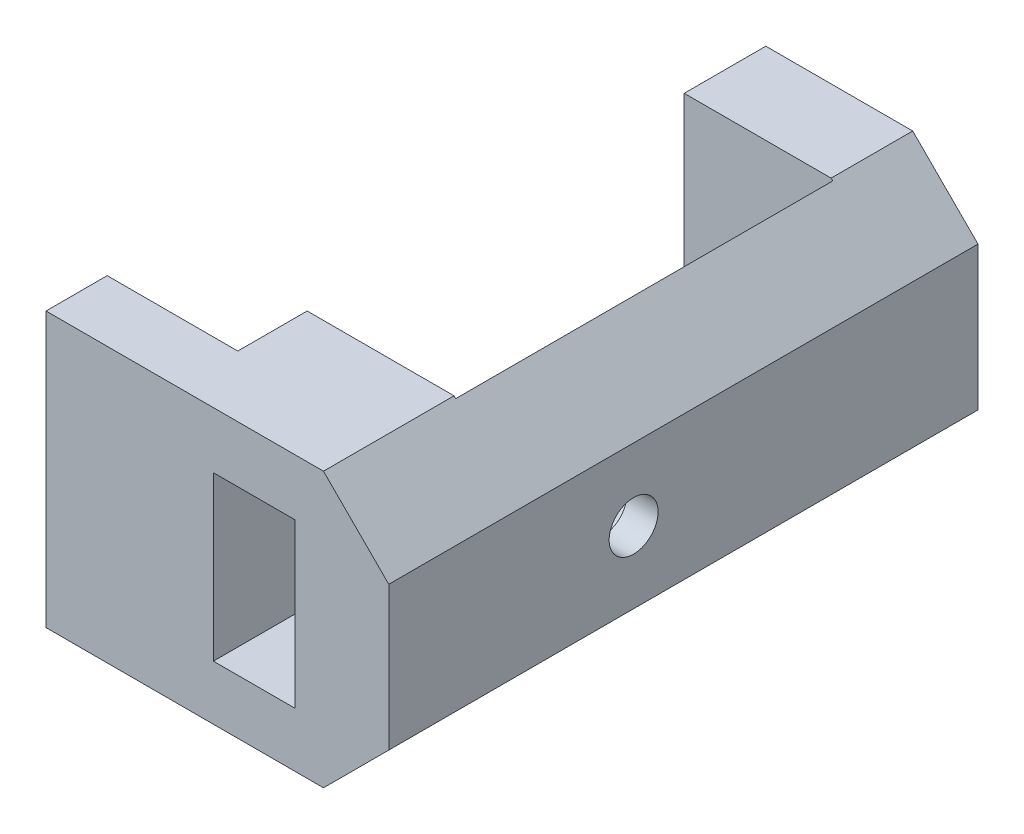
ISO-10303-21;
HEADER;
FILE_DESCRIPTION(('STEP AP214'),'2;1');
FILE_NAME('part.step','',(''),(''),'','','');
FILE_SCHEMA(('AUTOMOTIVE_DESIGN { 1 0 10303 214 1 1 1 1 }'));
ENDSEC;
DATA;
#1=APPLICATION_CONTEXT('core data for automotive mechanical design processes');
#2=APPLICATION_PROTOCOL_DEFINITION('international standard','automotive_design',2000,#1);
#3=PRODUCT_CONTEXT('',#1,'mechanical');
#4=PRODUCT('Part','Part','',(#3));
#5=PRODUCT_RELATED_PRODUCT_CATEGORY('part','',(#4));
#6=PRODUCT_DEFINITION_FORMATION('','',#4);
#7=PRODUCT_DEFINITION_CONTEXT('part definition',#1,'design');
#8=PRODUCT_DEFINITION('design','',#6,#7);
#9=PRODUCT_DEFINITION_SHAPE('','',#8);
#10=(LENGTH_UNIT() NAMED_UNIT(*) SI_UNIT(.MILLI.,.METRE.));
#11=(NAMED_UNIT(*) PLANE_ANGLE_UNIT() SI_UNIT($,.RADIAN.));
#12=(NAMED_UNIT(*) SI_UNIT($,.STERADIAN.) SOLID_ANGLE_UNIT());
#13=UNCERTAINTY_MEASURE_WITH_UNIT(LENGTH_MEASURE(1.E-05),#10,'distance_accuracy_value','');
#14=(GEOMETRIC_REPRESENTATION_CONTEXT(3) GLOBAL_UNCERTAINTY_ASSIGNED_CONTEXT((#13)) GLOBAL_UNIT_ASSIGNED_CONTEXT((#10,
#11,#12)) REPRESENTATION_CONTEXT('',''));
#15=CARTESIAN_POINT('',(0.,0.,0.));
#16=DIRECTION('',(0.,0.,1.));
#17=DIRECTION('',(1.,0.,0.));
#18=AXIS2_PLACEMENT_3D('',#15,#16,#17);
#19=CARTESIAN_POINT('',(0.,0.,0.));
#20=DIRECTION('',(0.,-1.,0.));
#21=DIRECTION('',(0.,0.,-1.));
#22=AXIS2_PLACEMENT_3D('',#19,#20,#21);
#23=PLANE('',#22);
#24=DIRECTION('',(-1.,0.,0.));
#25=VECTOR('',#24,1.);
#26=CARTESIAN_POINT('',(0.,0.,-33.1));
#27=LINE('',#26,#25);
#28=CARTESIAN_POINT('',(8.99999999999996,0.,-33.1));
#29=VERTEX_POINT('',#28);
#30=CARTESIAN_POINT('',(0.,0.,-33.1));
#31=VERTEX_POINT('',#30);
#32=EDGE_CURVE('E323',#29,#31,#27,.T.);
#33=ORIENTED_EDGE('',*,*,#32,.F.);
#34=DIRECTION('',(0.,0.,1.));
#35=VECTOR('',#34,1.);
#36=CARTESIAN_POINT('',(8.99999999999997,0.,0.));
#37=LINE('',#36,#35);
#38=CARTESIAN_POINT('',(8.99999999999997,0.,-28.1));
#39=VERTEX_POINT('',#38);
#40=EDGE_CURVE('E11',#29,#39,#37,.T.);
#41=ORIENTED_EDGE('',*,*,#40,.T.);
#42=DIRECTION('',(1.,0.,0.));
#43=VECTOR('',#42,1.);
#44=CARTESIAN_POINT('',(0.,0.,-28.1));
#45=LINE('',#44,#43);
#46=CARTESIAN_POINT('',(0.,0.,-28.1));
#47=VERTEX_POINT('',#46);
#48=EDGE_CURVE('E327',#47,#39,#45,.T.);
#49=ORIENTED_EDGE('',*,*,#48,.F.);
#50=DIRECTION('',(0.,0.,1.));
#51=VECTOR('',#50,1.);
#52=CARTESIAN_POINT('',(0.,0.,-33.1));
#53=LINE('',#52,#51);
#54=EDGE_CURVE('E325',#31,#47,#53,.T.);
#55=ORIENTED_EDGE('',*,*,#54,.F.);
#56=EDGE_LOOP('',(#33,#41,#49,#55));
#57=FACE_BOUND('',#56,.T.);
#58=ADVANCED_FACE('F36',(#57),#23,.T.);
#59=CARTESIAN_POINT('',(0.,16.8,0.));
#60=DIRECTION('',(0.,-1.,0.));
#61=DIRECTION('',(0.,0.,-1.));
#62=AXIS2_PLACEMENT_3D('',#59,#60,#61);
#63=PLANE('',#62);
#64=DIRECTION('',(0.,0.,1.));
#65=VECTOR('',#64,1.);
#66=CARTESIAN_POINT('',(0.,16.8,0.));
#67=LINE('',#66,#65);
#68=CARTESIAN_POINT('',(0.,16.8,-5.));
#69=VERTEX_POINT('',#68);
#70=CARTESIAN_POINT('',(0.,16.8,-0.750000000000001));
#71=VERTEX_POINT('',#70);
#72=EDGE_CURVE('E307',#69,#71,#67,.T.);
#73=ORIENTED_EDGE('',*,*,#72,.T.);
#74=DIRECTION('',(1.,0.,0.));
#75=VECTOR('',#74,1.);
#76=CARTESIAN_POINT('',(-8.,16.8,-0.749999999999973));
#77=LINE('',#76,#75);
#78=CARTESIAN_POINT('',(-8.,16.8,-0.749999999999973));
#79=VERTEX_POINT('',#78);
#80=EDGE_CURVE('E242',#79,#71,#77,.T.);
#81=ORIENTED_EDGE('',*,*,#80,.F.);
#82=DIRECTION('',(0.,0.,-1.));
#83=VECTOR('',#82,1.);
#84=CARTESIAN_POINT('',(-8.,16.8,0.));
#85=LINE('',#84,#83);
#86=CARTESIAN_POINT('',(-7.99999999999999,16.8,3.00000000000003));
#87=VERTEX_POINT('',#86);
#88=EDGE_CURVE('E240',#87,#79,#85,.T.);
#89=ORIENTED_EDGE('',*,*,#88,.F.);
#90=DIRECTION('',(-1.,0.,0.));
#91=VECTOR('',#90,1.);
#92=CARTESIAN_POINT('',(8.99999999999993,16.8,3.));
#93=LINE('',#92,#91);
#94=CARTESIAN_POINT('',(8.99999999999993,16.8,3.));
#95=VERTEX_POINT('',#94);
#96=EDGE_CURVE('E260',#95,#87,#93,.T.);
#97=ORIENTED_EDGE('',*,*,#96,.F.);
#98=DIRECTION('',(0.,0.,-1.));
#99=VECTOR('',#98,1.);
#100=CARTESIAN_POINT('',(8.99999999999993,16.8,0.));
#101=LINE('',#100,#99);
#102=CARTESIAN_POINT('',(8.99999999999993,16.8,-5.));
#103=VERTEX_POINT('',#102);
#104=EDGE_CURVE('E352',#95,#103,#101,.T.);
#105=ORIENTED_EDGE('',*,*,#104,.T.);
#106=DIRECTION('',(-1.,0.,0.));
#107=VECTOR('',#106,1.);
#108=CARTESIAN_POINT('',(0.,16.8,-5.));
#109=LINE('',#108,#107);
#110=EDGE_CURVE('E318',#103,#69,#109,.T.);
#111=ORIENTED_EDGE('',*,*,#110,.T.);
#112=EDGE_LOOP('',(#73,#81,#89,#97,#105,#111));
#113=FACE_BOUND('',#112,.T.);
#114=ADVANCED_FACE('F408',(#113),#63,.F.);
#115=CARTESIAN_POINT('',(3.,8.40000000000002,-12.));
#116=DIRECTION('',(1.,0.,0.));
#117=DIRECTION('',(0.,0.,-1.));
#118=AXIS2_PLACEMENT_3D('',#115,#116,#117);
#119=CYLINDRICAL_SURFACE('',#118,1.5);
#120=CARTESIAN_POINT('',(13.,8.40000000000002,-12.));
#121=DIRECTION('',(1.,0.,0.));
#122=DIRECTION('',(0.,0.,-1.));
#123=AXIS2_PLACEMENT_3D('',#120,#121,#122);
#124=CIRCLE('',#123,1.5);
#125=CARTESIAN_POINT('',(13.,8.40000000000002,-13.5));
#126=VERTEX_POINT('',#125);
#127=EDGE_CURVE('E303',#126,#126,#124,.T.);
#128=ORIENTED_EDGE('',*,*,#127,.T.);
#129=EDGE_LOOP('',(#128));
#130=FACE_BOUND('',#129,.T.);
#131=CARTESIAN_POINT('',(11.1,8.40000000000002,-12.));
#132=DIRECTION('',(-1.,0.,0.));
#133=DIRECTION('',(0.,0.,1.));
#134=AXIS2_PLACEMENT_3D('',#131,#132,#133);
#135=CIRCLE('',#134,1.5);
#136=CARTESIAN_POINT('',(11.1,8.40000000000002,-10.5));
#137=VERTEX_POINT('',#136);
#138=EDGE_CURVE('E294',#137,#137,#135,.F.);
#139=ORIENTED_EDGE('',*,*,#138,.F.);
#140=EDGE_LOOP('',(#139));
#141=FACE_BOUND('',#140,.T.);
#142=ADVANCED_FACE('F450',(#130,#141),#119,.F.);
#143=CARTESIAN_POINT('',(0.,16.8,0.));
#144=DIRECTION('',(1.,0.,0.));
#145=DIRECTION('',(0.,0.,-1.));
#146=AXIS2_PLACEMENT_3D('',#143,#144,#145);
#147=PLANE('',#146);
#148=DIRECTION('',(0.,0.,1.));
#149=VECTOR('',#148,1.);
#150=CARTESIAN_POINT('',(0.,0.,0.));
#151=LINE('',#150,#149);
#152=CARTESIAN_POINT('',(0.,0.,-5.));
#153=VERTEX_POINT('',#152);
#154=CARTESIAN_POINT('',(0.,0.,-0.750000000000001));
#155=VERTEX_POINT('',#154);
#156=EDGE_CURVE('E306',#153,#155,#151,.T.);
#157=ORIENTED_EDGE('',*,*,#156,.T.);
#158=DIRECTION('',(0.,1.,0.));
#159=VECTOR('',#158,1.);
#160=CARTESIAN_POINT('',(0.,0.,-0.750000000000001));
#161=LINE('',#160,#159);
#162=EDGE_CURVE('E227',#155,#71,#161,.T.);
#163=ORIENTED_EDGE('',*,*,#162,.T.);
#164=ORIENTED_EDGE('',*,*,#72,.F.);
#165=DIRECTION('',(0.,-1.,0.));
#166=VECTOR('',#165,1.);
#167=CARTESIAN_POINT('',(0.,16.8,-5.));
#168=LINE('',#167,#166);
#169=EDGE_CURVE('E320',#69,#153,#168,.T.);
#170=ORIENTED_EDGE('',*,*,#169,.T.);
#171=EDGE_LOOP('',(#157,#163,#164,#170));
#172=FACE_BOUND('',#171,.T.);
#173=ADVANCED_FACE('F419',(#172),#147,.F.);
#174=CARTESIAN_POINT('',(13.,16.8,0.));
#175=DIRECTION('',(-1.,0.,0.));
#176=DIRECTION('',(0.,0.,1.));
#177=AXIS2_PLACEMENT_3D('',#174,#175,#176);
#178=PLANE('',#177);
#179=ORIENTED_EDGE('',*,*,#127,.F.);
#180=EDGE_LOOP('',(#179));
#181=FACE_BOUND('',#180,.T.);
#182=DIRECTION('',(0.,-1.,0.));
#183=VECTOR('',#182,1.);
#184=CARTESIAN_POINT('',(13.,16.8,-33.1));
#185=LINE('',#184,#183);
#186=CARTESIAN_POINT('',(13.,12.8,-33.1));
#187=VERTEX_POINT('',#186);
#188=CARTESIAN_POINT('',(13.,4.00000000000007,-33.1));
#189=VERTEX_POINT('',#188);
#190=EDGE_CURVE('E345',#187,#189,#185,.T.);
#191=ORIENTED_EDGE('',*,*,#190,.F.);
#192=DIRECTION('',(0.,0.,1.));
#193=VECTOR('',#192,1.);
#194=CARTESIAN_POINT('',(13.,12.8,0.));
#195=LINE('',#194,#193);
#196=CARTESIAN_POINT('',(13.,12.8,3.));
#197=VERTEX_POINT('',#196);
#198=EDGE_CURVE('E374',#187,#197,#195,.T.);
#199=ORIENTED_EDGE('',*,*,#198,.T.);
#200=DIRECTION('',(0.,1.,0.));
#201=VECTOR('',#200,1.);
#202=CARTESIAN_POINT('',(13.,4.00000000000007,3.));
#203=LINE('',#202,#201);
#204=CARTESIAN_POINT('',(13.,4.00000000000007,3.));
#205=VERTEX_POINT('',#204);
#206=EDGE_CURVE('E254',#205,#197,#203,.T.);
#207=ORIENTED_EDGE('',*,*,#206,.F.);
#208=DIRECTION('',(0.,0.,-1.));
#209=VECTOR('',#208,1.);
#210=CARTESIAN_POINT('',(13.,4.00000000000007,-33.1));
#211=LINE('',#210,#209);
#212=EDGE_CURVE('E371',#205,#189,#211,.T.);
#213=ORIENTED_EDGE('',*,*,#212,.T.);
#214=EDGE_LOOP('',(#191,#199,#207,#213));
#215=FACE_BOUND('',#214,.T.);
#216=ADVANCED_FACE('F392',(#181,#215),#178,.F.);
#217=CARTESIAN_POINT('',(0.,16.8,-33.1));
#218=DIRECTION('',(0.,0.,1.));
#219=DIRECTION('',(1.,0.,0.));
#220=AXIS2_PLACEMENT_3D('',#217,#218,#219);
#221=PLANE('',#220);
#222=DIRECTION('',(-1.,0.,0.));
#223=VECTOR('',#222,1.);
#224=CARTESIAN_POINT('',(0.,16.8,-33.1));
#225=LINE('',#224,#223);
#226=CARTESIAN_POINT('',(8.99999999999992,16.8,-33.1));
#227=VERTEX_POINT('',#226);
#228=CARTESIAN_POINT('',(0.,16.8,-33.1));
#229=VERTEX_POINT('',#228);
#230=EDGE_CURVE('E310',#227,#229,#225,.T.);
#231=ORIENTED_EDGE('',*,*,#230,.F.);
#232=DIRECTION('',(-0.707106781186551,0.707106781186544,0.));
#233=VECTOR('',#232,1.);
#234=CARTESIAN_POINT('',(8.99999999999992,16.8,-33.1));
#235=LINE('',#234,#233);
#236=EDGE_CURVE('E369',#227,#187,#235,.F.);
#237=ORIENTED_EDGE('',*,*,#236,.T.);
#238=ORIENTED_EDGE('',*,*,#190,.T.);
#239=DIRECTION('',(-0.707106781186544,-0.707106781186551,0.));
#240=VECTOR('',#239,1.);
#241=CARTESIAN_POINT('',(13.,4.00000000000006,-33.1));
#242=LINE('',#241,#240);
#243=EDGE_CURVE('E367',#189,#29,#242,.T.);
#244=ORIENTED_EDGE('',*,*,#243,.T.);
#245=ORIENTED_EDGE('',*,*,#32,.T.);
#246=DIRECTION('',(0.,-1.,0.));
#247=VECTOR('',#246,1.);
#248=CARTESIAN_POINT('',(0.,16.8,-33.1));
#249=LINE('',#248,#247);
#250=EDGE_CURVE('E342',#229,#31,#249,.T.);
#251=ORIENTED_EDGE('',*,*,#250,.F.);
#252=EDGE_LOOP('',(#231,#237,#238,#244,#245,#251));
#253=FACE_BOUND('',#252,.T.);
#254=ADVANCED_FACE('F396',(#253),#221,.F.);
#255=CARTESIAN_POINT('',(0.,16.8,-33.1));
#256=DIRECTION('',(1.,0.,0.));
#257=DIRECTION('',(0.,0.,-1.));
#258=AXIS2_PLACEMENT_3D('',#255,#256,#257);
#259=PLANE('',#258);
#260=CARTESIAN_POINT('',(0.,8.4,-30.6));
#261=DIRECTION('',(-1.,0.,0.));
#262=DIRECTION('',(0.,0.,1.));
#263=AXIS2_PLACEMENT_3D('',#260,#261,#262);
#264=CIRCLE('',#263,1.);
#265=CARTESIAN_POINT('',(0.,8.4,-29.6));
#266=VERTEX_POINT('',#265);
#267=EDGE_CURVE('E214',#266,#266,#264,.T.);
#268=ORIENTED_EDGE('',*,*,#267,.F.);
#269=EDGE_LOOP('',(#268));
#270=FACE_BOUND('',#269,.T.);
#271=ORIENTED_EDGE('',*,*,#54,.T.);
#272=DIRECTION('',(0.,-1.,0.));
#273=VECTOR('',#272,1.);
#274=CARTESIAN_POINT('',(0.,16.8,-28.1));
#275=LINE('',#274,#273);
#276=CARTESIAN_POINT('',(0.,16.8,-28.1));
#277=VERTEX_POINT('',#276);
#278=EDGE_CURVE('E339',#277,#47,#275,.T.);
#279=ORIENTED_EDGE('',*,*,#278,.F.);
#280=DIRECTION('',(0.,0.,1.));
#281=VECTOR('',#280,1.);
#282=CARTESIAN_POINT('',(0.,16.8,-33.1));
#283=LINE('',#282,#281);
#284=EDGE_CURVE('E313',#229,#277,#283,.T.);
#285=ORIENTED_EDGE('',*,*,#284,.F.);
#286=ORIENTED_EDGE('',*,*,#250,.T.);
#287=EDGE_LOOP('',(#271,#279,#285,#286));
#288=FACE_BOUND('',#287,.T.);
#289=ADVANCED_FACE('F436',(#270,#288),#259,.F.);
#290=CARTESIAN_POINT('',(0.,16.8,-28.1));
#291=DIRECTION('',(0.,0.,-1.));
#292=DIRECTION('',(-1.,0.,0.));
#293=AXIS2_PLACEMENT_3D('',#290,#291,#292);
#294=PLANE('',#293);
#295=DIRECTION('',(0.,-1.,0.));
#296=VECTOR('',#295,1.);
#297=CARTESIAN_POINT('',(9.09999999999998,16.8,-28.1));
#298=LINE('',#297,#296);
#299=CARTESIAN_POINT('',(9.09999999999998,16.6999999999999,-28.1));
#300=VERTEX_POINT('',#299);
#301=CARTESIAN_POINT('',(9.09999999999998,0.100000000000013,-28.1));
#302=VERTEX_POINT('',#301);
#303=EDGE_CURVE('E336',#300,#302,#298,.T.);
#304=ORIENTED_EDGE('',*,*,#303,.F.);
#305=DIRECTION('',(0.707106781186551,-0.707106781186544,0.));
#306=VECTOR('',#305,1.);
#307=CARTESIAN_POINT('',(8.99999999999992,16.8,-28.1));
#308=LINE('',#307,#306);
#309=CARTESIAN_POINT('',(8.99999999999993,16.8,-28.1));
#310=VERTEX_POINT('',#309);
#311=EDGE_CURVE('E365',#300,#310,#308,.F.);
#312=ORIENTED_EDGE('',*,*,#311,.T.);
#313=DIRECTION('',(1.,0.,0.));
#314=VECTOR('',#313,1.);
#315=CARTESIAN_POINT('',(0.,16.8,-28.1));
#316=LINE('',#315,#314);
#317=EDGE_CURVE('E315',#277,#310,#316,.T.);
#318=ORIENTED_EDGE('',*,*,#317,.F.);
#319=ORIENTED_EDGE('',*,*,#278,.T.);
#320=ORIENTED_EDGE('',*,*,#48,.T.);
#321=DIRECTION('',(0.707106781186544,0.707106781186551,0.));
#322=VECTOR('',#321,1.);
#323=CARTESIAN_POINT('',(13.,4.00000000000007,-28.1));
#324=LINE('',#323,#322);
#325=EDGE_CURVE('E363',#39,#302,#324,.T.);
#326=ORIENTED_EDGE('',*,*,#325,.T.);
#327=EDGE_LOOP('',(#304,#312,#318,#319,#320,#326));
#328=FACE_BOUND('',#327,.T.);
#329=ADVANCED_FACE('F428',(#328),#294,.F.);
#330=CARTESIAN_POINT('',(9.09999999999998,16.8,-5.));
#331=DIRECTION('',(1.,0.,0.));
#332=DIRECTION('',(0.,0.,-1.));
#333=AXIS2_PLACEMENT_3D('',#330,#331,#332);
#334=PLANE('',#333);
#335=DIRECTION('',(0.,-0.914175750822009,-0.405318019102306));
#336=VECTOR('',#335,1.);
#337=CARTESIAN_POINT('',(9.09999999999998,11.8277742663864,-13.9861275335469));
#338=LINE('',#337,#336);
#339=CARTESIAN_POINT('',(9.09999999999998,11.8277742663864,-13.9861275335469));
#340=VERTEX_POINT('',#339);
#341=CARTESIAN_POINT('',(9.09999999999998,7.57032096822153,-15.8737542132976));
#342=VERTEX_POINT('',#341);
#343=EDGE_CURVE('E281',#340,#342,#338,.T.);
#344=ORIENTED_EDGE('',*,*,#343,.F.);
#345=DIRECTION('',(0.,0.102984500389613,-0.994682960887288));
#346=VECTOR('',#345,1.);
#347=CARTESIAN_POINT('',(9.09999999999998,11.3481600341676,-9.35374010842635));
#348=LINE('',#347,#346);
#349=CARTESIAN_POINT('',(9.09999999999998,11.3481600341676,-9.35374010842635));
#350=VERTEX_POINT('',#349);
#351=EDGE_CURVE('E262',#350,#340,#348,.T.);
#352=ORIENTED_EDGE('',*,*,#351,.F.);
#353=DIRECTION('',(0.,0.977823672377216,-0.20942985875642));
#354=VECTOR('',#353,1.);
#355=CARTESIAN_POINT('',(9.09999999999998,6.79428883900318,-8.37839391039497));
#356=LINE('',#355,#354);
#357=CARTESIAN_POINT('',(9.09999999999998,6.79428883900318,-8.37839391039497));
#358=VERTEX_POINT('',#357);
#359=EDGE_CURVE('E267',#358,#350,#356,.T.);
#360=ORIENTED_EDGE('',*,*,#359,.F.);
#361=DIRECTION('',(0.,0.501343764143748,0.86524818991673));
#362=VECTOR('',#361,1.);
#363=CARTESIAN_POINT('',(9.09999999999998,4.45945589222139,-12.4079842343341));
#364=LINE('',#363,#362);
#365=CARTESIAN_POINT('',(9.09999999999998,4.45945589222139,-12.4079842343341));
#366=VERTEX_POINT('',#365);
#367=EDGE_CURVE('E287',#366,#358,#364,.T.);
#368=ORIENTED_EDGE('',*,*,#367,.F.);
#369=DIRECTION('',(0.,-0.66797618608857,0.744182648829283));
#370=VECTOR('',#369,1.);
#371=CARTESIAN_POINT('',(9.09999999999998,7.57032096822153,-15.8737542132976));
#372=LINE('',#371,#370);
#373=EDGE_CURVE('E284',#342,#366,#372,.T.);
#374=ORIENTED_EDGE('',*,*,#373,.F.);
#375=EDGE_LOOP('',(#344,#352,#360,#368,#374));
#376=FACE_BOUND('',#375,.T.);
#377=DIRECTION('',(0.,-1.,0.));
#378=VECTOR('',#377,1.);
#379=CARTESIAN_POINT('',(9.09999999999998,16.8,-5.));
#380=LINE('',#379,#378);
#381=CARTESIAN_POINT('',(9.09999999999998,16.6999999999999,-5.));
#382=VERTEX_POINT('',#381);
#383=CARTESIAN_POINT('',(9.09999999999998,0.100000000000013,-5.));
#384=VERTEX_POINT('',#383);
#385=EDGE_CURVE('E333',#382,#384,#380,.T.);
#386=ORIENTED_EDGE('',*,*,#385,.F.);
#387=DIRECTION('',(0.,0.,1.));
#388=VECTOR('',#387,1.);
#389=CARTESIAN_POINT('',(9.09999999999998,16.6999999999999,0.));
#390=LINE('',#389,#388);
#391=EDGE_CURVE('E361',#382,#300,#390,.F.);
#392=ORIENTED_EDGE('',*,*,#391,.T.);
#393=ORIENTED_EDGE('',*,*,#303,.T.);
#394=DIRECTION('',(0.,0.,1.));
#395=VECTOR('',#394,1.);
#396=CARTESIAN_POINT('',(9.09999999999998,0.100000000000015,0.));
#397=LINE('',#396,#395);
#398=EDGE_CURVE('E359',#302,#384,#397,.T.);
#399=ORIENTED_EDGE('',*,*,#398,.T.);
#400=EDGE_LOOP('',(#386,#392,#393,#399));
#401=FACE_BOUND('',#400,.T.);
#402=ADVANCED_FACE('F424',(#376,#401),#334,.F.);
#403=CARTESIAN_POINT('',(0.,16.8,-5.));
#404=DIRECTION('',(0.,0.,1.));
#405=DIRECTION('',(1.,0.,0.));
#406=AXIS2_PLACEMENT_3D('',#403,#404,#405);
#407=PLANE('',#406);
#408=DIRECTION('',(0.,1.,0.));
#409=VECTOR('',#408,1.);
#410=CARTESIAN_POINT('',(7.25610982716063,13.3481855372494,-5.));
#411=LINE('',#410,#409);
#412=CARTESIAN_POINT('',(7.25610982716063,3.34818553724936,-5.));
#413=VERTEX_POINT('',#412);
#414=CARTESIAN_POINT('',(7.25610982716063,13.3481855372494,-5.));
#415=VERTEX_POINT('',#414);
#416=EDGE_CURVE('E198',#413,#415,#411,.T.);
#417=ORIENTED_EDGE('',*,*,#416,.T.);
#418=DIRECTION('',(-1.,0.,0.));
#419=VECTOR('',#418,1.);
#420=CARTESIAN_POINT('',(7.25610982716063,13.3481855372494,-5.));
#421=LINE('',#420,#419);
#422=CARTESIAN_POINT('',(2.25610982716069,13.3481855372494,-5.));
#423=VERTEX_POINT('',#422);
#424=EDGE_CURVE('E192',#415,#423,#421,.T.);
#425=ORIENTED_EDGE('',*,*,#424,.T.);
#426=DIRECTION('',(0.,-1.,0.));
#427=VECTOR('',#426,1.);
#428=CARTESIAN_POINT('',(2.25610982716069,13.3481855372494,-5.));
#429=LINE('',#428,#427);
#430=CARTESIAN_POINT('',(2.25610982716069,3.34818553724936,-5.));
#431=VERTEX_POINT('',#430);
#432=EDGE_CURVE('E201',#423,#431,#429,.T.);
#433=ORIENTED_EDGE('',*,*,#432,.T.);
#434=DIRECTION('',(1.,0.,0.));
#435=VECTOR('',#434,1.);
#436=CARTESIAN_POINT('',(7.25610982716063,3.34818553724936,-5.));
#437=LINE('',#436,#435);
#438=EDGE_CURVE('E51',#431,#413,#437,.T.);
#439=ORIENTED_EDGE('',*,*,#438,.T.);
#440=EDGE_LOOP('',(#417,#425,#433,#439));
#441=FACE_BOUND('',#440,.T.);
#442=ORIENTED_EDGE('',*,*,#110,.F.);
#443=DIRECTION('',(-0.707106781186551,0.707106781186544,0.));
#444=VECTOR('',#443,1.);
#445=CARTESIAN_POINT('',(8.99999999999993,16.8,-5.));
#446=LINE('',#445,#444);
#447=EDGE_CURVE('E357',#103,#382,#446,.F.);
#448=ORIENTED_EDGE('',*,*,#447,.T.);
#449=ORIENTED_EDGE('',*,*,#385,.T.);
#450=DIRECTION('',(-0.707106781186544,-0.707106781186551,0.));
#451=VECTOR('',#450,1.);
#452=CARTESIAN_POINT('',(13.,4.00000000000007,-5.));
#453=LINE('',#452,#451);
#454=CARTESIAN_POINT('',(8.99999999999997,0.,-5.));
#455=VERTEX_POINT('',#454);
#456=EDGE_CURVE('E355',#384,#455,#453,.T.);
#457=ORIENTED_EDGE('',*,*,#456,.T.);
#458=DIRECTION('',(-1.,0.,0.));
#459=VECTOR('',#458,1.);
#460=CARTESIAN_POINT('',(0.,0.,-5.));
#461=LINE('',#460,#459);
#462=EDGE_CURVE('E311',#455,#153,#461,.T.);
#463=ORIENTED_EDGE('',*,*,#462,.T.);
#464=ORIENTED_EDGE('',*,*,#169,.F.);
#465=EDGE_LOOP('',(#442,#448,#449,#457,#463,#464));
#466=FACE_BOUND('',#465,.T.);
#467=ADVANCED_FACE('F205',(#441,#466),#407,.F.);
#468=ORIENTED_EDGE('',*,*,#317,.T.);
#469=DIRECTION('',(0.,0.,-1.));
#470=VECTOR('',#469,1.);
#471=CARTESIAN_POINT('',(8.99999999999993,16.8,0.));
#472=LINE('',#471,#470);
#473=EDGE_CURVE('E348',#310,#227,#472,.T.);
#474=ORIENTED_EDGE('',*,*,#473,.T.);
#475=ORIENTED_EDGE('',*,*,#230,.T.);
#476=ORIENTED_EDGE('',*,*,#284,.T.);
#477=EDGE_LOOP('',(#468,#474,#475,#476));
#478=FACE_BOUND('',#477,.T.);
#479=ADVANCED_FACE('F438',(#478),#63,.F.);
#480=ORIENTED_EDGE('',*,*,#462,.F.);
#481=DIRECTION('',(0.,0.,1.));
#482=VECTOR('',#481,1.);
#483=CARTESIAN_POINT('',(8.99999999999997,0.,0.));
#484=LINE('',#483,#482);
#485=CARTESIAN_POINT('',(8.99999999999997,0.,3.));
#486=VERTEX_POINT('',#485);
#487=EDGE_CURVE('E44',#455,#486,#484,.T.);
#488=ORIENTED_EDGE('',*,*,#487,.T.);
#489=DIRECTION('',(1.,0.,0.));
#490=VECTOR('',#489,1.);
#491=CARTESIAN_POINT('',(0.,0.,3.));
#492=LINE('',#491,#490);
#493=CARTESIAN_POINT('',(-7.99999999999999,0.,3.00000000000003));
#494=VERTEX_POINT('',#493);
#495=EDGE_CURVE('E248',#494,#486,#492,.T.);
#496=ORIENTED_EDGE('',*,*,#495,.F.);
#497=DIRECTION('',(0.,0.,1.));
#498=VECTOR('',#497,1.);
#499=CARTESIAN_POINT('',(-8.,0.,0.));
#500=LINE('',#499,#498);
#501=CARTESIAN_POINT('',(-8.,0.,-0.749999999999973));
#502=VERTEX_POINT('',#501);
#503=EDGE_CURVE('E234',#502,#494,#500,.T.);
#504=ORIENTED_EDGE('',*,*,#503,.F.);
#505=DIRECTION('',(1.,0.,0.));
#506=VECTOR('',#505,1.);
#507=CARTESIAN_POINT('',(-8.,0.,-0.749999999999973));
#508=LINE('',#507,#506);
#509=EDGE_CURVE('E246',#502,#155,#508,.T.);
#510=ORIENTED_EDGE('',*,*,#509,.T.);
#511=ORIENTED_EDGE('',*,*,#156,.F.);
#512=EDGE_LOOP('',(#480,#488,#496,#504,#510,#511));
#513=FACE_BOUND('',#512,.T.);
#514=ADVANCED_FACE('F378',(#513),#23,.T.);
#515=CARTESIAN_POINT('',(11.1,0.,0.));
#516=DIRECTION('',(-1.,0.,0.));
#517=DIRECTION('',(0.,0.,1.));
#518=AXIS2_PLACEMENT_3D('',#515,#516,#517);
#519=PLANE('',#518);
#520=DIRECTION('',(0.,0.102984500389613,-0.994682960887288));
#521=VECTOR('',#520,1.);
#522=CARTESIAN_POINT('',(11.1,11.3481600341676,-9.35374010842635));
#523=LINE('',#522,#521);
#524=CARTESIAN_POINT('',(11.1,11.3481600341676,-9.35374010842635));
#525=VERTEX_POINT('',#524);
#526=CARTESIAN_POINT('',(11.1,11.8277742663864,-13.9861275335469));
#527=VERTEX_POINT('',#526);
#528=EDGE_CURVE('E263',#525,#527,#523,.T.);
#529=ORIENTED_EDGE('',*,*,#528,.T.);
#530=DIRECTION('',(0.,-0.914175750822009,-0.405318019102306));
#531=VECTOR('',#530,1.);
#532=CARTESIAN_POINT('',(11.1,11.8277742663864,-13.9861275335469));
#533=LINE('',#532,#531);
#534=CARTESIAN_POINT('',(11.1,7.57032096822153,-15.8737542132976));
#535=VERTEX_POINT('',#534);
#536=EDGE_CURVE('E266',#527,#535,#533,.T.);
#537=ORIENTED_EDGE('',*,*,#536,.T.);
#538=DIRECTION('',(0.,-0.66797618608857,0.744182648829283));
#539=VECTOR('',#538,1.);
#540=CARTESIAN_POINT('',(11.1,7.57032096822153,-15.8737542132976));
#541=LINE('',#540,#539);
#542=CARTESIAN_POINT('',(11.1,4.45945589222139,-12.4079842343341));
#543=VERTEX_POINT('',#542);
#544=EDGE_CURVE('E270',#535,#543,#541,.T.);
#545=ORIENTED_EDGE('',*,*,#544,.T.);
#546=DIRECTION('',(0.,0.501343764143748,0.86524818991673));
#547=VECTOR('',#546,1.);
#548=CARTESIAN_POINT('',(11.1,4.45945589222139,-12.4079842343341));
#549=LINE('',#548,#547);
#550=CARTESIAN_POINT('',(11.1,6.79428883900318,-8.37839391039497));
#551=VERTEX_POINT('',#550);
#552=EDGE_CURVE('E273',#543,#551,#549,.T.);
#553=ORIENTED_EDGE('',*,*,#552,.T.);
#554=DIRECTION('',(0.,0.977823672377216,-0.20942985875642));
#555=VECTOR('',#554,1.);
#556=CARTESIAN_POINT('',(11.1,6.79428883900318,-8.37839391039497));
#557=LINE('',#556,#555);
#558=EDGE_CURVE('E276',#551,#525,#557,.T.);
#559=ORIENTED_EDGE('',*,*,#558,.T.);
#560=EDGE_LOOP('',(#529,#537,#545,#553,#559));
#561=FACE_BOUND('',#560,.T.);
#562=ORIENTED_EDGE('',*,*,#138,.T.);
#563=EDGE_LOOP('',(#562));
#564=FACE_BOUND('',#563,.T.);
#565=ADVANCED_FACE('F445',(#561,#564),#519,.T.);
#566=CARTESIAN_POINT('',(11.1,11.3481600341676,-9.35374010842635));
#567=DIRECTION('',(0.,0.994682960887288,0.102984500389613));
#568=DIRECTION('',(0.,-0.102984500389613,0.994682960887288));
#569=AXIS2_PLACEMENT_3D('',#566,#567,#568);
#570=PLANE('',#569);
#571=ORIENTED_EDGE('',*,*,#351,.T.);
#572=DIRECTION('',(-1.,0.,0.));
#573=VECTOR('',#572,1.);
#574=CARTESIAN_POINT('',(11.1,11.8277742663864,-13.9861275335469));
#575=LINE('',#574,#573);
#576=EDGE_CURVE('E279',#527,#340,#575,.T.);
#577=ORIENTED_EDGE('',*,*,#576,.F.);
#578=ORIENTED_EDGE('',*,*,#528,.F.);
#579=DIRECTION('',(-1.,0.,0.));
#580=VECTOR('',#579,1.);
#581=CARTESIAN_POINT('',(11.1,11.3481600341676,-9.35374010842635));
#582=LINE('',#581,#580);
#583=EDGE_CURVE('E292',#525,#350,#582,.T.);
#584=ORIENTED_EDGE('',*,*,#583,.T.);
#585=EDGE_LOOP('',(#571,#577,#578,#584));
#586=FACE_BOUND('',#585,.T.);
#587=ADVANCED_FACE('F486',(#586),#570,.F.);
#588=CARTESIAN_POINT('',(11.1,6.79428883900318,-8.37839391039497));
#589=DIRECTION('',(0.,0.20942985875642,0.977823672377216));
#590=DIRECTION('',(0.,-0.977823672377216,0.20942985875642));
#591=AXIS2_PLACEMENT_3D('',#588,#589,#590);
#592=PLANE('',#591);
#593=ORIENTED_EDGE('',*,*,#359,.T.);
#594=ORIENTED_EDGE('',*,*,#583,.F.);
#595=ORIENTED_EDGE('',*,*,#558,.F.);
#596=DIRECTION('',(-1.,0.,0.));
#597=VECTOR('',#596,1.);
#598=CARTESIAN_POINT('',(11.1,6.79428883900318,-8.37839391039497));
#599=LINE('',#598,#597);
#600=EDGE_CURVE('E295',#551,#358,#599,.T.);
#601=ORIENTED_EDGE('',*,*,#600,.T.);
#602=EDGE_LOOP('',(#593,#594,#595,#601));
#603=FACE_BOUND('',#602,.T.);
#604=ADVANCED_FACE('F488',(#603),#592,.F.);
#605=CARTESIAN_POINT('',(11.1,4.45945589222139,-12.4079842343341));
#606=DIRECTION('',(0.,-0.865248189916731,0.501343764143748));
#607=DIRECTION('',(0.,-0.501343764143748,-0.86524818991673));
#608=AXIS2_PLACEMENT_3D('',#605,#606,#607);
#609=PLANE('',#608);
#610=ORIENTED_EDGE('',*,*,#367,.T.);
#611=ORIENTED_EDGE('',*,*,#600,.F.);
#612=ORIENTED_EDGE('',*,*,#552,.F.);
#613=DIRECTION('',(-1.,0.,0.));
#614=VECTOR('',#613,1.);
#615=CARTESIAN_POINT('',(11.1,4.45945589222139,-12.4079842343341));
#616=LINE('',#615,#614);
#617=EDGE_CURVE('E297',#543,#366,#616,.T.);
#618=ORIENTED_EDGE('',*,*,#617,.T.);
#619=EDGE_LOOP('',(#610,#611,#612,#618));
#620=FACE_BOUND('',#619,.T.);
#621=ADVANCED_FACE('F481',(#620),#609,.F.);
#622=CARTESIAN_POINT('',(11.1,7.57032096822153,-15.8737542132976));
#623=DIRECTION('',(0.,-0.744182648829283,-0.66797618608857));
#624=DIRECTION('',(0.,0.66797618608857,-0.744182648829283));
#625=AXIS2_PLACEMENT_3D('',#622,#623,#624);
#626=PLANE('',#625);
#627=ORIENTED_EDGE('',*,*,#373,.T.);
#628=ORIENTED_EDGE('',*,*,#617,.F.);
#629=ORIENTED_EDGE('',*,*,#544,.F.);
#630=DIRECTION('',(-1.,0.,0.));
#631=VECTOR('',#630,1.);
#632=CARTESIAN_POINT('',(11.1,7.57032096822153,-15.8737542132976));
#633=LINE('',#632,#631);
#634=EDGE_CURVE('E299',#535,#342,#633,.T.);
#635=ORIENTED_EDGE('',*,*,#634,.T.);
#636=EDGE_LOOP('',(#627,#628,#629,#635));
#637=FACE_BOUND('',#636,.T.);
#638=ADVANCED_FACE('F475',(#637),#626,.F.);
#639=CARTESIAN_POINT('',(11.1,11.8277742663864,-13.9861275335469));
#640=DIRECTION('',(0.,0.405318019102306,-0.914175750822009));
#641=DIRECTION('',(0.,0.914175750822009,0.405318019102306));
#642=AXIS2_PLACEMENT_3D('',#639,#640,#641);
#643=PLANE('',#642);
#644=ORIENTED_EDGE('',*,*,#343,.T.);
#645=ORIENTED_EDGE('',*,*,#634,.F.);
#646=ORIENTED_EDGE('',*,*,#536,.F.);
#647=ORIENTED_EDGE('',*,*,#576,.T.);
#648=EDGE_LOOP('',(#644,#645,#646,#647));
#649=FACE_BOUND('',#648,.T.);
#650=ADVANCED_FACE('F470',(#649),#643,.F.);
#651=CARTESIAN_POINT('',(8.99999999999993,16.8,0.));
#652=DIRECTION('',(-0.707106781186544,-0.707106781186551,0.));
#653=DIRECTION('',(0.,0.,-1.));
#654=AXIS2_PLACEMENT_3D('',#651,#652,#653);
#655=PLANE('',#654);
#656=ORIENTED_EDGE('',*,*,#104,.F.);
#657=DIRECTION('',(-0.707106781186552,0.707106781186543,0.));
#658=VECTOR('',#657,1.);
#659=CARTESIAN_POINT('',(13.,12.8,3.));
#660=LINE('',#659,#658);
#661=EDGE_CURVE('E257',#197,#95,#660,.T.);
#662=ORIENTED_EDGE('',*,*,#661,.F.);
#663=ORIENTED_EDGE('',*,*,#198,.F.);
#664=ORIENTED_EDGE('',*,*,#236,.F.);
#665=ORIENTED_EDGE('',*,*,#473,.F.);
#666=ORIENTED_EDGE('',*,*,#311,.F.);
#667=ORIENTED_EDGE('',*,*,#391,.F.);
#668=ORIENTED_EDGE('',*,*,#447,.F.);
#669=EDGE_LOOP('',(#656,#662,#663,#664,#665,#666,#667,#668));
#670=FACE_BOUND('',#669,.T.);
#671=ADVANCED_FACE('F402',(#670),#655,.F.);
#672=CARTESIAN_POINT('',(13.,4.00000000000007,0.));
#673=DIRECTION('',(0.707106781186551,-0.707106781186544,0.));
#674=DIRECTION('',(0.,0.,1.));
#675=AXIS2_PLACEMENT_3D('',#672,#673,#674);
#676=PLANE('',#675);
#677=ORIENTED_EDGE('',*,*,#325,.F.);
#678=ORIENTED_EDGE('',*,*,#40,.F.);
#679=ORIENTED_EDGE('',*,*,#243,.F.);
#680=ORIENTED_EDGE('',*,*,#212,.F.);
#681=DIRECTION('',(0.707106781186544,0.707106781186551,0.));
#682=VECTOR('',#681,1.);
#683=CARTESIAN_POINT('',(8.99999999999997,0.,3.));
#684=LINE('',#683,#682);
#685=EDGE_CURVE('E251',#486,#205,#684,.T.);
#686=ORIENTED_EDGE('',*,*,#685,.F.);
#687=ORIENTED_EDGE('',*,*,#487,.F.);
#688=ORIENTED_EDGE('',*,*,#456,.F.);
#689=ORIENTED_EDGE('',*,*,#398,.F.);
#690=EDGE_LOOP('',(#677,#678,#679,#680,#686,#687,#688,#689));
#691=FACE_BOUND('',#690,.T.);
#692=ADVANCED_FACE('F38',(#691),#676,.T.);
#693=CARTESIAN_POINT('',(0.,0.,3.));
#694=DIRECTION('',(0.,0.,1.));
#695=DIRECTION('',(1.,0.,0.));
#696=AXIS2_PLACEMENT_3D('',#693,#694,#695);
#697=PLANE('',#696);
#698=DIRECTION('',(-1.,0.,0.));
#699=VECTOR('',#698,1.);
#700=CARTESIAN_POINT('',(7.25610982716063,13.3481855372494,3.));
#701=LINE('',#700,#699);
#702=CARTESIAN_POINT('',(7.25610982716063,13.3481855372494,3.));
#703=VERTEX_POINT('',#702);
#704=CARTESIAN_POINT('',(2.25610982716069,13.3481855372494,3.));
#705=VERTEX_POINT('',#704);
#706=EDGE_CURVE('E59',#703,#705,#701,.T.);
#707=ORIENTED_EDGE('',*,*,#706,.F.);
#708=DIRECTION('',(0.,1.,0.));
#709=VECTOR('',#708,1.);
#710=CARTESIAN_POINT('',(7.25610982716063,13.3481855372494,3.));
#711=LINE('',#710,#709);
#712=CARTESIAN_POINT('',(7.25610982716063,3.34818553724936,3.));
#713=VERTEX_POINT('',#712);
#714=EDGE_CURVE('E208',#713,#703,#711,.T.);
#715=ORIENTED_EDGE('',*,*,#714,.F.);
#716=DIRECTION('',(1.,0.,0.));
#717=VECTOR('',#716,1.);
#718=CARTESIAN_POINT('',(7.25610982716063,3.34818553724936,3.));
#719=LINE('',#718,#717);
#720=CARTESIAN_POINT('',(2.25610982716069,3.34818553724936,3.));
#721=VERTEX_POINT('',#720);
#722=EDGE_CURVE('E211',#721,#713,#719,.T.);
#723=ORIENTED_EDGE('',*,*,#722,.F.);
#724=DIRECTION('',(0.,-1.,0.));
#725=VECTOR('',#724,1.);
#726=CARTESIAN_POINT('',(2.25610982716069,13.3481855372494,3.));
#727=LINE('',#726,#725);
#728=EDGE_CURVE('E220',#705,#721,#727,.T.);
#729=ORIENTED_EDGE('',*,*,#728,.F.);
#730=EDGE_LOOP('',(#707,#715,#723,#729));
#731=FACE_BOUND('',#730,.T.);
#732=ORIENTED_EDGE('',*,*,#96,.T.);
#733=DIRECTION('',(0.,1.,0.));
#734=VECTOR('',#733,1.);
#735=CARTESIAN_POINT('',(-7.99999999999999,0.,3.00000000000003));
#736=LINE('',#735,#734);
#737=EDGE_CURVE('E237',#494,#87,#736,.T.);
#738=ORIENTED_EDGE('',*,*,#737,.F.);
#739=ORIENTED_EDGE('',*,*,#495,.T.);
#740=ORIENTED_EDGE('',*,*,#685,.T.);
#741=ORIENTED_EDGE('',*,*,#206,.T.);
#742=ORIENTED_EDGE('',*,*,#661,.T.);
#743=EDGE_LOOP('',(#732,#738,#739,#740,#741,#742));
#744=FACE_BOUND('',#743,.T.);
#745=ADVANCED_FACE('F386',(#731,#744),#697,.T.);
#746=CARTESIAN_POINT('',(-8.,0.,-0.749999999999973));
#747=DIRECTION('',(0.,0.,-1.));
#748=DIRECTION('',(-1.,0.,0.));
#749=AXIS2_PLACEMENT_3D('',#746,#747,#748);
#750=PLANE('',#749);
#751=ORIENTED_EDGE('',*,*,#162,.F.);
#752=ORIENTED_EDGE('',*,*,#509,.F.);
#753=DIRECTION('',(0.,1.,0.));
#754=VECTOR('',#753,1.);
#755=CARTESIAN_POINT('',(-8.,0.,-0.749999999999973));
#756=LINE('',#755,#754);
#757=EDGE_CURVE('E231',#502,#79,#756,.T.);
#758=ORIENTED_EDGE('',*,*,#757,.T.);
#759=ORIENTED_EDGE('',*,*,#80,.T.);
#760=EDGE_LOOP('',(#751,#752,#758,#759));
#761=FACE_BOUND('',#760,.T.);
#762=ADVANCED_FACE('F416',(#761),#750,.T.);
#763=CARTESIAN_POINT('',(-8.,0.,0.));
#764=DIRECTION('',(-1.,0.,0.));
#765=DIRECTION('',(0.,0.,1.));
#766=AXIS2_PLACEMENT_3D('',#763,#764,#765);
#767=PLANE('',#766);
#768=ORIENTED_EDGE('',*,*,#757,.F.);
#769=ORIENTED_EDGE('',*,*,#503,.T.);
#770=ORIENTED_EDGE('',*,*,#737,.T.);
#771=ORIENTED_EDGE('',*,*,#88,.T.);
#772=EDGE_LOOP('',(#768,#769,#770,#771));
#773=FACE_BOUND('',#772,.T.);
#774=ADVANCED_FACE('F413',(#773),#767,.T.);
#775=CARTESIAN_POINT('',(7.25610982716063,13.3481855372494,-5.));
#776=DIRECTION('',(0.,1.,0.));
#777=DIRECTION('',(0.,0.,1.));
#778=AXIS2_PLACEMENT_3D('',#775,#776,#777);
#779=PLANE('',#778);
#780=ORIENTED_EDGE('',*,*,#706,.T.);
#781=DIRECTION('',(0.,0.,1.));
#782=VECTOR('',#781,1.);
#783=CARTESIAN_POINT('',(2.25610982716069,13.3481855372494,-5.));
#784=LINE('',#783,#782);
#785=EDGE_CURVE('E188',#423,#705,#784,.T.);
#786=ORIENTED_EDGE('',*,*,#785,.F.);
#787=ORIENTED_EDGE('',*,*,#424,.F.);
#788=DIRECTION('',(0.,0.,1.));
#789=VECTOR('',#788,1.);
#790=CARTESIAN_POINT('',(7.25610982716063,13.3481855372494,-5.));
#791=LINE('',#790,#789);
#792=EDGE_CURVE('E225',#415,#703,#791,.T.);
#793=ORIENTED_EDGE('',*,*,#792,.T.);
#794=EDGE_LOOP('',(#780,#786,#787,#793));
#795=FACE_BOUND('',#794,.T.);
#796=ADVANCED_FACE('F190',(#795),#779,.F.);
#797=CARTESIAN_POINT('',(7.25610982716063,13.3481855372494,-5.));
#798=DIRECTION('',(1.,0.,0.));
#799=DIRECTION('',(0.,0.,-1.));
#800=AXIS2_PLACEMENT_3D('',#797,#798,#799);
#801=PLANE('',#800);
#802=ORIENTED_EDGE('',*,*,#714,.T.);
#803=ORIENTED_EDGE('',*,*,#792,.F.);
#804=ORIENTED_EDGE('',*,*,#416,.F.);
#805=DIRECTION('',(0.,0.,1.));
#806=VECTOR('',#805,1.);
#807=CARTESIAN_POINT('',(7.25610982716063,3.34818553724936,-5.));
#808=LINE('',#807,#806);
#809=EDGE_CURVE('E228',#413,#713,#808,.T.);
#810=ORIENTED_EDGE('',*,*,#809,.T.);
#811=EDGE_LOOP('',(#802,#803,#804,#810));
#812=FACE_BOUND('',#811,.T.);
#813=ADVANCED_FACE('F646',(#812),#801,.F.);
#814=CARTESIAN_POINT('',(7.25610982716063,3.34818553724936,-5.));
#815=DIRECTION('',(0.,-1.,0.));
#816=DIRECTION('',(0.,0.,-1.));
#817=AXIS2_PLACEMENT_3D('',#814,#815,#816);
#818=PLANE('',#817);
#819=ORIENTED_EDGE('',*,*,#722,.T.);
#820=ORIENTED_EDGE('',*,*,#809,.F.);
#821=ORIENTED_EDGE('',*,*,#438,.F.);
#822=DIRECTION('',(0.,0.,1.));
#823=VECTOR('',#822,1.);
#824=CARTESIAN_POINT('',(2.25610982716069,3.34818553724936,-5.));
#825=LINE('',#824,#823);
#826=EDGE_CURVE('E197',#431,#721,#825,.T.);
#827=ORIENTED_EDGE('',*,*,#826,.T.);
#828=EDGE_LOOP('',(#819,#820,#821,#827));
#829=FACE_BOUND('',#828,.T.);
#830=ADVANCED_FACE('F655',(#829),#818,.F.);
#831=CARTESIAN_POINT('',(2.25610982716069,13.3481855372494,-5.));
#832=DIRECTION('',(-1.,0.,0.));
#833=DIRECTION('',(0.,0.,1.));
#834=AXIS2_PLACEMENT_3D('',#831,#832,#833);
#835=PLANE('',#834);
#836=ORIENTED_EDGE('',*,*,#728,.T.);
#837=ORIENTED_EDGE('',*,*,#826,.F.);
#838=ORIENTED_EDGE('',*,*,#432,.F.);
#839=ORIENTED_EDGE('',*,*,#785,.T.);
#840=EDGE_LOOP('',(#836,#837,#838,#839));
#841=FACE_BOUND('',#840,.T.);
#842=ADVANCED_FACE('F202',(#841),#835,.F.);
#843=CARTESIAN_POINT('',(6.0000000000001,8.4,-30.6));
#844=DIRECTION('',(-1.,0.,0.));
#845=DIRECTION('',(0.,0.,1.));
#846=AXIS2_PLACEMENT_3D('',#843,#844,#845);
#847=CYLINDRICAL_SURFACE('',#846,1.);
#848=CARTESIAN_POINT('',(6.0000000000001,8.4,-30.6));
#849=DIRECTION('',(-1.,0.,0.));
#850=DIRECTION('',(0.,0.,1.));
#851=AXIS2_PLACEMENT_3D('',#848,#849,#850);
#852=CIRCLE('',#851,1.);
#853=CARTESIAN_POINT('',(6.0000000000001,8.4,-29.6));
#854=VERTEX_POINT('',#853);
#855=EDGE_CURVE('E221',#854,#854,#852,.T.);
#856=ORIENTED_EDGE('',*,*,#855,.F.);
#857=EDGE_LOOP('',(#856));
#858=FACE_BOUND('',#857,.T.);
#859=ORIENTED_EDGE('',*,*,#267,.T.);
#860=EDGE_LOOP('',(#859));
#861=FACE_BOUND('',#860,.T.);
#862=ADVANCED_FACE('F672',(#858,#861),#847,.F.);
#863=CARTESIAN_POINT('',(6.0000000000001,8.4,-30.6));
#864=DIRECTION('',(-1.,0.,0.));
#865=DIRECTION('',(0.,0.,1.));
#866=AXIS2_PLACEMENT_3D('',#863,#864,#865);
#867=PLANE('',#866);
#868=ORIENTED_EDGE('',*,*,#855,.T.);
#869=EDGE_LOOP('',(#868));
#870=FACE_BOUND('',#869,.T.);
#871=ADVANCED_FACE('F684',(#870),#867,.T.);
#872=CLOSED_SHELL('',(#58,#114,#142,#173,#216,#254,#289,#329,#402,#467,#479,#514,#565,#587,#604,
#621,#638,#650,#671,#692,#745,#762,#774,#796,#813,#830,#842,#862,#871));
#873=MANIFOLD_SOLID_BREP('B2',#872);
#874=ADVANCED_BREP_SHAPE_REPRESENTATION('',(#18,#873),#14);
#875=SHAPE_DEFINITION_REPRESENTATION(#9,#874);
ENDSEC;
END-ISO-10303-21;
